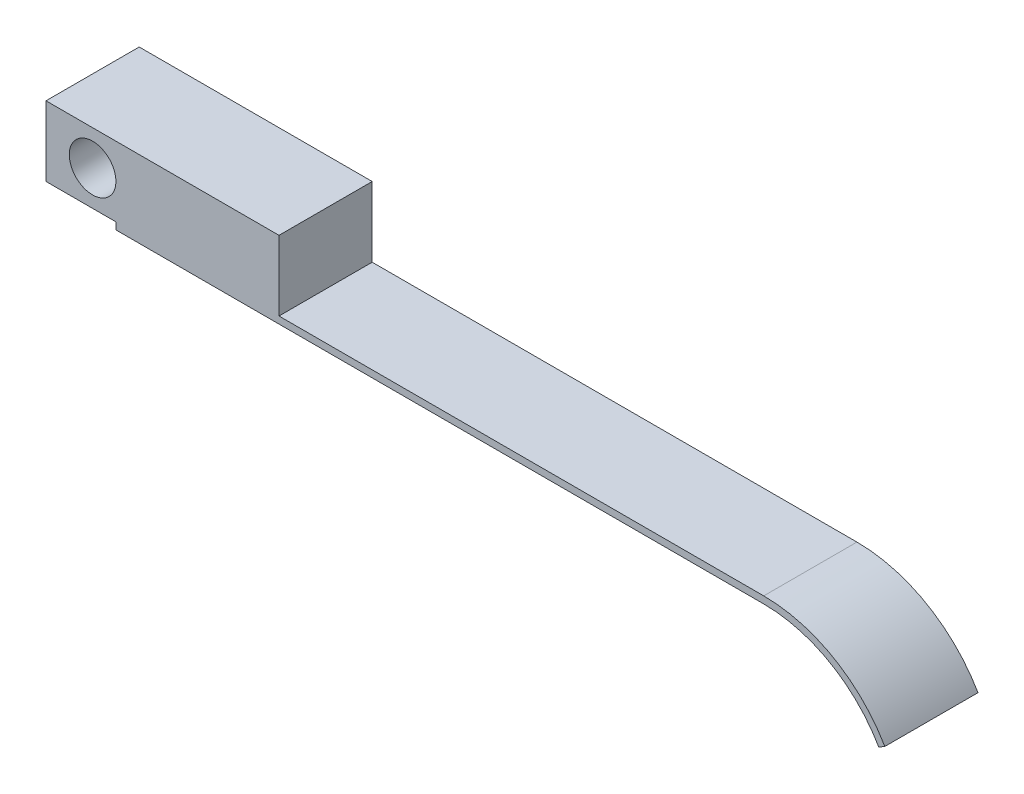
from build123d import *

# Parameters (mm, degrees)
ESQUISSE1_W          = 50
ESQUISSE1_H          = 15
ESQUISSE1_R          = 5
BASE_EXTRUSION_DEPTH = 20
BOSS_EXTRU_1_DEPTH   = 20


with BuildPart() as part:
    # Esquisse1 → Base-Extrusion (new body)
    with BuildSketch(Plane.XY):
        with Locations((25, 7.5)):
            Rectangle(ESQUISSE1_W, ESQUISSE1_H)
        with Locations((10, 7.5)):
            Circle(ESQUISSE1_R, mode=Mode.SUBTRACT)
    extrude(amount=BASE_EXTRUSION_DEPTH)

    # Esquisse2 → Boss.-Extru.1 (add, through all)
    with BuildSketch(Plane.XY.offset(20)):
        with BuildLine():
            Line((15, 0), (154.019237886, 0))
            ThreePointArc((154.019237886, 0), (169.019237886, -4.019237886), (180, -15))
            Line((180, -15), (178.700961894, -15.75))
            ThreePointArc((178.700961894, -15.75), (168.269237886, -5.318275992), (154.019237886, -1.5))
            Line((154.019237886, -1.5), (15, -1.5))
            Line((15, -1.5), (15, 0))
        make_face()
    extrude(amount=-BOSS_EXTRU_1_DEPTH)


solid = part.part
